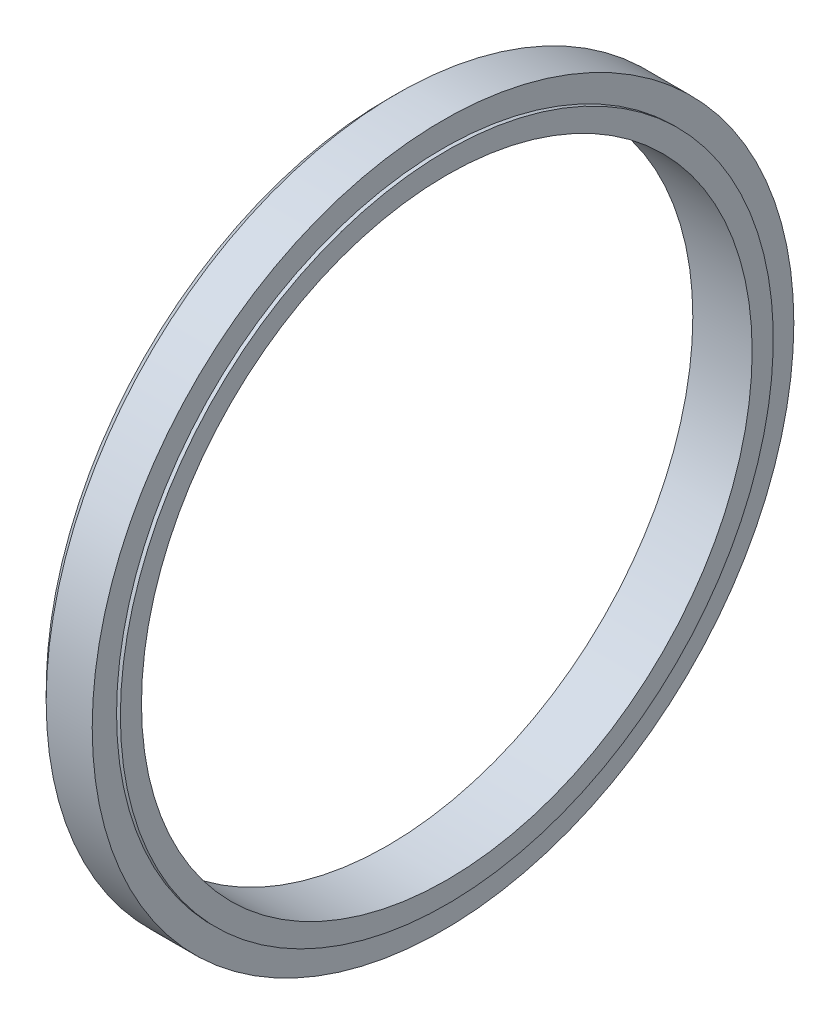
ISO-10303-21;
HEADER;
FILE_DESCRIPTION(('STEP AP214'),'2;1');
FILE_NAME('part.step','',(''),(''),'','','');
FILE_SCHEMA(('AUTOMOTIVE_DESIGN { 1 0 10303 214 1 1 1 1 }'));
ENDSEC;
DATA;
#1=APPLICATION_CONTEXT('core data for automotive mechanical design processes');
#2=APPLICATION_PROTOCOL_DEFINITION('international standard','automotive_design',2000,#1);
#3=PRODUCT_CONTEXT('',#1,'mechanical');
#4=PRODUCT('Part','Part','',(#3));
#5=PRODUCT_RELATED_PRODUCT_CATEGORY('part','',(#4));
#6=PRODUCT_DEFINITION_FORMATION('','',#4);
#7=PRODUCT_DEFINITION_CONTEXT('part definition',#1,'design');
#8=PRODUCT_DEFINITION('design','',#6,#7);
#9=PRODUCT_DEFINITION_SHAPE('','',#8);
#10=(LENGTH_UNIT() NAMED_UNIT(*) SI_UNIT(.MILLI.,.METRE.));
#11=(NAMED_UNIT(*) PLANE_ANGLE_UNIT() SI_UNIT($,.RADIAN.));
#12=(NAMED_UNIT(*) SI_UNIT($,.STERADIAN.) SOLID_ANGLE_UNIT());
#13=UNCERTAINTY_MEASURE_WITH_UNIT(LENGTH_MEASURE(1.E-05),#10,'distance_accuracy_value','');
#14=(GEOMETRIC_REPRESENTATION_CONTEXT(3) GLOBAL_UNCERTAINTY_ASSIGNED_CONTEXT((#13)) GLOBAL_UNIT_ASSIGNED_CONTEXT((#10,
#11,#12)) REPRESENTATION_CONTEXT('',''));
#15=CARTESIAN_POINT('',(0.,0.,0.));
#16=DIRECTION('',(0.,0.,1.));
#17=DIRECTION('',(1.,0.,0.));
#18=AXIS2_PLACEMENT_3D('',#15,#16,#17);
#19=CARTESIAN_POINT('',(0.,8.025,0.));
#20=DIRECTION('',(1.,0.,0.));
#21=DIRECTION('',(0.,0.,-1.));
#22=AXIS2_PLACEMENT_3D('',#19,#20,#21);
#23=PLANE('',#22);
#24=CARTESIAN_POINT('',(0.,0.,0.));
#25=DIRECTION('',(1.,0.,0.));
#26=DIRECTION('',(0.,0.,-1.));
#27=AXIS2_PLACEMENT_3D('',#24,#25,#26);
#28=CIRCLE('',#27,8.97000000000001);
#29=CARTESIAN_POINT('',(0.,0.,-8.97000000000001));
#30=VERTEX_POINT('',#29);
#31=EDGE_CURVE('E48',#30,#30,#28,.F.);
#32=ORIENTED_EDGE('',*,*,#31,.T.);
#33=EDGE_LOOP('',(#32));
#34=FACE_BOUND('',#33,.T.);
#35=CARTESIAN_POINT('',(0.,0.,0.));
#36=DIRECTION('',(-1.,0.,0.));
#37=DIRECTION('',(0.,0.,1.));
#38=AXIS2_PLACEMENT_3D('',#35,#36,#37);
#39=CIRCLE('',#38,8.025);
#40=CARTESIAN_POINT('',(0.,0.,8.025));
#41=VERTEX_POINT('',#40);
#42=EDGE_CURVE('E72',#41,#41,#39,.T.);
#43=ORIENTED_EDGE('',*,*,#42,.F.);
#44=EDGE_LOOP('',(#43));
#45=FACE_BOUND('',#44,.T.);
#46=ADVANCED_FACE('F39',(#34,#45),#23,.F.);
#47=CARTESIAN_POINT('',(-2.51414177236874,0.,0.));
#48=DIRECTION('',(-1.,0.,0.));
#49=DIRECTION('',(0.,0.,1.));
#50=AXIS2_PLACEMENT_3D('',#47,#48,#49);
#51=CYLINDRICAL_SURFACE('',#50,9.22);
#52=CARTESIAN_POINT('',(0.249999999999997,0.,0.));
#53=DIRECTION('',(1.,0.,0.));
#54=DIRECTION('',(0.,0.,-1.));
#55=AXIS2_PLACEMENT_3D('',#52,#53,#54);
#56=CIRCLE('',#55,9.22);
#57=CARTESIAN_POINT('',(0.249999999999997,0.,-9.22));
#58=VERTEX_POINT('',#57);
#59=EDGE_CURVE('E10',#58,#58,#56,.T.);
#60=ORIENTED_EDGE('',*,*,#59,.T.);
#61=EDGE_LOOP('',(#60));
#62=FACE_BOUND('',#61,.T.);
#63=CARTESIAN_POINT('',(1.46,0.,0.));
#64=DIRECTION('',(-1.,0.,0.));
#65=DIRECTION('',(0.,0.,1.));
#66=AXIS2_PLACEMENT_3D('',#63,#64,#65);
#67=CIRCLE('',#66,9.22);
#68=CARTESIAN_POINT('',(1.46,0.,9.22));
#69=VERTEX_POINT('',#68);
#70=EDGE_CURVE('E53',#69,#69,#67,.T.);
#71=ORIENTED_EDGE('',*,*,#70,.T.);
#72=EDGE_LOOP('',(#71));
#73=FACE_BOUND('',#72,.T.);
#74=ADVANCED_FACE('F80',(#62,#73),#51,.T.);
#75=CARTESIAN_POINT('',(1.46,8.58,0.));
#76=DIRECTION('',(-1.,0.,0.));
#77=DIRECTION('',(0.,0.,1.));
#78=AXIS2_PLACEMENT_3D('',#75,#76,#77);
#79=PLANE('',#78);
#80=ORIENTED_EDGE('',*,*,#70,.F.);
#81=EDGE_LOOP('',(#80));
#82=FACE_BOUND('',#81,.T.);
#83=CARTESIAN_POINT('',(1.46,0.,0.));
#84=DIRECTION('',(-1.,0.,0.));
#85=DIRECTION('',(0.,0.,1.));
#86=AXIS2_PLACEMENT_3D('',#83,#84,#85);
#87=CIRCLE('',#86,8.58);
#88=CARTESIAN_POINT('',(1.46,0.,8.58));
#89=VERTEX_POINT('',#88);
#90=EDGE_CURVE('E58',#89,#89,#87,.T.);
#91=ORIENTED_EDGE('',*,*,#90,.T.);
#92=EDGE_LOOP('',(#91));
#93=FACE_BOUND('',#92,.T.);
#94=ADVANCED_FACE('F84',(#82,#93),#79,.F.);
#95=CARTESIAN_POINT('',(-2.51414177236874,0.,0.));
#96=DIRECTION('',(-1.,0.,0.));
#97=DIRECTION('',(0.,0.,1.));
#98=AXIS2_PLACEMENT_3D('',#95,#96,#97);
#99=CYLINDRICAL_SURFACE('',#98,8.58);
#100=ORIENTED_EDGE('',*,*,#90,.F.);
#101=EDGE_LOOP('',(#100));
#102=FACE_BOUND('',#101,.T.);
#103=CARTESIAN_POINT('',(1.56,0.,0.));
#104=DIRECTION('',(-1.,0.,0.));
#105=DIRECTION('',(0.,0.,1.));
#106=AXIS2_PLACEMENT_3D('',#103,#104,#105);
#107=CIRCLE('',#106,8.58);
#108=CARTESIAN_POINT('',(1.56,0.,8.58));
#109=VERTEX_POINT('',#108);
#110=EDGE_CURVE('E64',#109,#109,#107,.T.);
#111=ORIENTED_EDGE('',*,*,#110,.T.);
#112=EDGE_LOOP('',(#111));
#113=FACE_BOUND('',#112,.T.);
#114=ADVANCED_FACE('F89',(#102,#113),#99,.T.);
#115=CARTESIAN_POINT('',(1.56,8.58,0.));
#116=DIRECTION('',(-1.,0.,0.));
#117=DIRECTION('',(0.,0.,1.));
#118=AXIS2_PLACEMENT_3D('',#115,#116,#117);
#119=PLANE('',#118);
#120=ORIENTED_EDGE('',*,*,#110,.F.);
#121=EDGE_LOOP('',(#120));
#122=FACE_BOUND('',#121,.T.);
#123=CARTESIAN_POINT('',(1.56,0.,0.));
#124=DIRECTION('',(-1.,0.,0.));
#125=DIRECTION('',(0.,0.,1.));
#126=AXIS2_PLACEMENT_3D('',#123,#124,#125);
#127=CIRCLE('',#126,8.025);
#128=CARTESIAN_POINT('',(1.56,0.,8.025));
#129=VERTEX_POINT('',#128);
#130=EDGE_CURVE('E68',#129,#129,#127,.T.);
#131=ORIENTED_EDGE('',*,*,#130,.T.);
#132=EDGE_LOOP('',(#131));
#133=FACE_BOUND('',#132,.T.);
#134=ADVANCED_FACE('F93',(#122,#133),#119,.F.);
#135=CARTESIAN_POINT('',(-2.51414177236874,0.,0.));
#136=DIRECTION('',(-1.,0.,0.));
#137=DIRECTION('',(0.,0.,1.));
#138=AXIS2_PLACEMENT_3D('',#135,#136,#137);
#139=CYLINDRICAL_SURFACE('',#138,8.025);
#140=ORIENTED_EDGE('',*,*,#130,.F.);
#141=EDGE_LOOP('',(#140));
#142=FACE_BOUND('',#141,.T.);
#143=ORIENTED_EDGE('',*,*,#42,.T.);
#144=EDGE_LOOP('',(#143));
#145=FACE_BOUND('',#144,.T.);
#146=ADVANCED_FACE('F77',(#142,#145),#139,.F.);
#147=CARTESIAN_POINT('',(0.,0.,0.));
#148=DIRECTION('',(1.,0.,0.));
#149=DIRECTION('',(0.,0.,-1.));
#150=AXIS2_PLACEMENT_3D('',#147,#148,#149);
#151=CONICAL_SURFACE('',#150,8.97000000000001,0.785398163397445);
#152=ORIENTED_EDGE('',*,*,#59,.F.);
#153=EDGE_LOOP('',(#152));
#154=FACE_BOUND('',#153,.T.);
#155=ORIENTED_EDGE('',*,*,#31,.F.);
#156=EDGE_LOOP('',(#155));
#157=FACE_BOUND('',#156,.T.);
#158=ADVANCED_FACE('F42',(#154,#157),#151,.T.);
#159=CLOSED_SHELL('',(#46,#74,#94,#114,#134,#146,#158));
#160=MANIFOLD_SOLID_BREP('B2',#159);
#161=ADVANCED_BREP_SHAPE_REPRESENTATION('',(#18,#160),#14);
#162=SHAPE_DEFINITION_REPRESENTATION(#9,#161);
ENDSEC;
END-ISO-10303-21;
